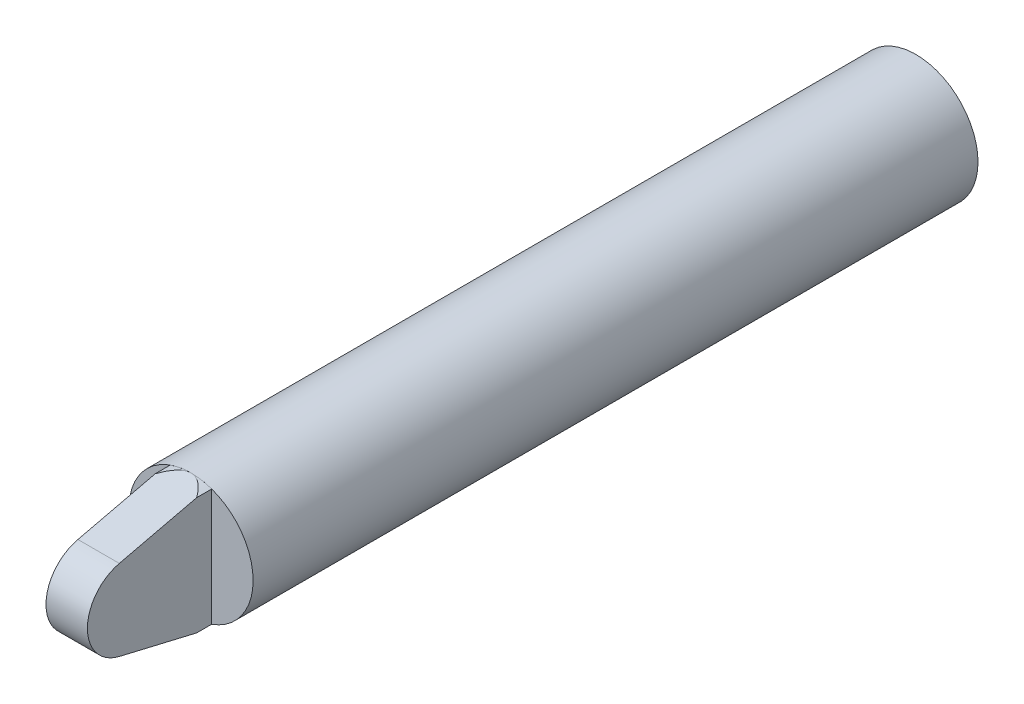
ISO-10303-21;
HEADER;
FILE_DESCRIPTION(('STEP AP214'),'2;1');
FILE_NAME('part.step','',(''),(''),'','','');
FILE_SCHEMA(('AUTOMOTIVE_DESIGN { 1 0 10303 214 1 1 1 1 }'));
ENDSEC;
DATA;
#1=APPLICATION_CONTEXT('core data for automotive mechanical design processes');
#2=APPLICATION_PROTOCOL_DEFINITION('international standard','automotive_design',2000,#1);
#3=PRODUCT_CONTEXT('',#1,'mechanical');
#4=PRODUCT('Part','Part','',(#3));
#5=PRODUCT_RELATED_PRODUCT_CATEGORY('part','',(#4));
#6=PRODUCT_DEFINITION_FORMATION('','',#4);
#7=PRODUCT_DEFINITION_CONTEXT('part definition',#1,'design');
#8=PRODUCT_DEFINITION('design','',#6,#7);
#9=PRODUCT_DEFINITION_SHAPE('','',#8);
#10=(LENGTH_UNIT() NAMED_UNIT(*) SI_UNIT(.MILLI.,.METRE.));
#11=(NAMED_UNIT(*) PLANE_ANGLE_UNIT() SI_UNIT($,.RADIAN.));
#12=(NAMED_UNIT(*) SI_UNIT($,.STERADIAN.) SOLID_ANGLE_UNIT());
#13=UNCERTAINTY_MEASURE_WITH_UNIT(LENGTH_MEASURE(1.E-05),#10,'distance_accuracy_value','');
#14=(GEOMETRIC_REPRESENTATION_CONTEXT(3) GLOBAL_UNCERTAINTY_ASSIGNED_CONTEXT((#13)) GLOBAL_UNIT_ASSIGNED_CONTEXT((#10,
#11,#12)) REPRESENTATION_CONTEXT('',''));
#15=CARTESIAN_POINT('',(0.,0.,0.));
#16=DIRECTION('',(0.,0.,1.));
#17=DIRECTION('',(1.,0.,0.));
#18=AXIS2_PLACEMENT_3D('',#15,#16,#17);
#19=CARTESIAN_POINT('',(10.,30.,350.));
#20=DIRECTION('',(0.,0.,1.));
#21=DIRECTION('',(1.,0.,0.));
#22=AXIS2_PLACEMENT_3D('',#19,#20,#21);
#23=PLANE('',#22);
#24=CARTESIAN_POINT('',(0.,0.,350.));
#25=DIRECTION('',(0.,0.,1.));
#26=DIRECTION('',(1.,0.,0.));
#27=AXIS2_PLACEMENT_3D('',#24,#25,#26);
#28=CIRCLE('',#27,30.);
#29=CARTESIAN_POINT('',(10.,28.2842712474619,350.));
#30=VERTEX_POINT('',#29);
#31=CARTESIAN_POINT('',(0.,30.,350.));
#32=VERTEX_POINT('',#31);
#33=EDGE_CURVE('E160',#30,#32,#28,.T.);
#34=ORIENTED_EDGE('',*,*,#33,.F.);
#35=DIRECTION('',(0.,1.,0.));
#36=VECTOR('',#35,1.);
#37=CARTESIAN_POINT('',(10.,30.,350.));
#38=LINE('',#37,#36);
#39=CARTESIAN_POINT('',(10.,-28.2842712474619,350.));
#40=VERTEX_POINT('',#39);
#41=EDGE_CURVE('E126',#40,#30,#38,.T.);
#42=ORIENTED_EDGE('',*,*,#41,.F.);
#43=CARTESIAN_POINT('',(0.,-30.,350.));
#44=VERTEX_POINT('',#43);
#45=EDGE_CURVE('E157',#44,#40,#28,.T.);
#46=ORIENTED_EDGE('',*,*,#45,.F.);
#47=CARTESIAN_POINT('',(-10.,-28.2842712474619,350.));
#48=VERTEX_POINT('',#47);
#49=EDGE_CURVE('E155',#48,#44,#28,.T.);
#50=ORIENTED_EDGE('',*,*,#49,.F.);
#51=DIRECTION('',(0.,1.,0.));
#52=VECTOR('',#51,1.);
#53=CARTESIAN_POINT('',(-10.,30.,350.));
#54=LINE('',#53,#52);
#55=CARTESIAN_POINT('',(-10.,28.2842712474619,350.));
#56=VERTEX_POINT('',#55);
#57=EDGE_CURVE('E116',#48,#56,#54,.T.);
#58=ORIENTED_EDGE('',*,*,#57,.T.);
#59=EDGE_CURVE('E60',#32,#56,#28,.T.);
#60=ORIENTED_EDGE('',*,*,#59,.F.);
#61=EDGE_LOOP('',(#34,#42,#46,#50,#58,#60));
#62=FACE_BOUND('',#61,.T.);
#63=ADVANCED_FACE('F39',(#62),#23,.F.);
#64=CARTESIAN_POINT('',(10.,30.,350.));
#65=DIRECTION('',(0.,-0.973212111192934,-0.229909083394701));
#66=DIRECTION('',(0.,0.229909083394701,-0.973212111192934));
#67=AXIS2_PLACEMENT_3D('',#64,#65,#66);
#68=PLANE('',#67);
#69=CARTESIAN_POINT('',(0.,0.,476.99090833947));
#70=DIRECTION('',(0.,-0.973212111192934,-0.229909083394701));
#71=DIRECTION('',(0.,0.229909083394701,-0.973212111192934));
#72=AXIS2_PLACEMENT_3D('',#69,#70,#71);
#73=ELLIPSE('',#72,130.486362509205,30.);
#74=CARTESIAN_POINT('',(10.,28.2842712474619,357.262731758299));
#75=VERTEX_POINT('',#74);
#76=EDGE_CURVE('E110',#32,#75,#73,.T.);
#77=ORIENTED_EDGE('',*,*,#76,.F.);
#78=CARTESIAN_POINT('',(-10.,28.2842712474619,357.262731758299));
#79=VERTEX_POINT('',#78);
#80=EDGE_CURVE('E97',#79,#32,#73,.T.);
#81=ORIENTED_EDGE('',*,*,#80,.F.);
#82=DIRECTION('',(0.,-0.229909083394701,0.973212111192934));
#83=VECTOR('',#82,1.);
#84=CARTESIAN_POINT('',(-10.,30.,350.));
#85=LINE('',#84,#83);
#86=CARTESIAN_POINT('',(-10.,19.4642422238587,394.598181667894));
#87=VERTEX_POINT('',#86);
#88=EDGE_CURVE('E107',#79,#87,#85,.T.);
#89=ORIENTED_EDGE('',*,*,#88,.T.);
#90=DIRECTION('',(-1.,0.,0.));
#91=VECTOR('',#90,1.);
#92=CARTESIAN_POINT('',(10.,19.4642422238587,394.598181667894));
#93=LINE('',#92,#91);
#94=CARTESIAN_POINT('',(10.,19.4642422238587,394.598181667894));
#95=VERTEX_POINT('',#94);
#96=EDGE_CURVE('E103',#95,#87,#93,.T.);
#97=ORIENTED_EDGE('',*,*,#96,.F.);
#98=DIRECTION('',(0.,-0.229909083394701,0.973212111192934));
#99=VECTOR('',#98,1.);
#100=CARTESIAN_POINT('',(10.,30.,350.));
#101=LINE('',#100,#99);
#102=EDGE_CURVE('E136',#75,#95,#101,.T.);
#103=ORIENTED_EDGE('',*,*,#102,.F.);
#104=EDGE_LOOP('',(#77,#81,#89,#97,#103));
#105=FACE_BOUND('',#104,.T.);
#106=ADVANCED_FACE('F105',(#105),#68,.F.);
#107=CARTESIAN_POINT('',(10.,-30.,350.));
#108=DIRECTION('',(0.,0.973212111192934,-0.229909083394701));
#109=DIRECTION('',(0.,0.229909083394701,0.973212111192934));
#110=AXIS2_PLACEMENT_3D('',#107,#108,#109);
#111=PLANE('',#110);
#112=CARTESIAN_POINT('',(0.,0.,476.99090833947));
#113=DIRECTION('',(0.,0.973212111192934,-0.229909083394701));
#114=DIRECTION('',(0.,-0.229909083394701,-0.973212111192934));
#115=AXIS2_PLACEMENT_3D('',#112,#113,#114);
#116=ELLIPSE('',#115,130.486362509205,30.);
#117=CARTESIAN_POINT('',(-10.,-28.2842712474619,357.262731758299));
#118=VERTEX_POINT('',#117);
#119=EDGE_CURVE('E52',#44,#118,#116,.T.);
#120=ORIENTED_EDGE('',*,*,#119,.F.);
#121=CARTESIAN_POINT('',(10.,-28.2842712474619,357.262731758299));
#122=VERTEX_POINT('',#121);
#123=EDGE_CURVE('E120',#122,#44,#116,.T.);
#124=ORIENTED_EDGE('',*,*,#123,.F.);
#125=DIRECTION('',(0.,-0.229909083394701,-0.973212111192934));
#126=VECTOR('',#125,1.);
#127=CARTESIAN_POINT('',(10.,-30.,350.));
#128=LINE('',#127,#126);
#129=CARTESIAN_POINT('',(10.,-19.4642422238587,394.598181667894));
#130=VERTEX_POINT('',#129);
#131=EDGE_CURVE('E130',#130,#122,#128,.T.);
#132=ORIENTED_EDGE('',*,*,#131,.F.);
#133=DIRECTION('',(-1.,0.,0.));
#134=VECTOR('',#133,1.);
#135=CARTESIAN_POINT('',(10.,-19.4642422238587,394.598181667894));
#136=LINE('',#135,#134);
#137=CARTESIAN_POINT('',(-10.,-19.4642422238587,394.598181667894));
#138=VERTEX_POINT('',#137);
#139=EDGE_CURVE('E127',#130,#138,#136,.T.);
#140=ORIENTED_EDGE('',*,*,#139,.T.);
#141=DIRECTION('',(0.,-0.229909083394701,-0.973212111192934));
#142=VECTOR('',#141,1.);
#143=CARTESIAN_POINT('',(-10.,-30.,350.));
#144=LINE('',#143,#142);
#145=EDGE_CURVE('E118',#138,#118,#144,.T.);
#146=ORIENTED_EDGE('',*,*,#145,.T.);
#147=EDGE_LOOP('',(#120,#124,#132,#140,#146));
#148=FACE_BOUND('',#147,.T.);
#149=ADVANCED_FACE('F152',(#148),#111,.F.);
#150=CARTESIAN_POINT('',(10.,0.,390.));
#151=DIRECTION('',(1.,0.,0.));
#152=DIRECTION('',(0.,0.,-1.));
#153=AXIS2_PLACEMENT_3D('',#150,#151,#152);
#154=PLANE('',#153);
#155=ORIENTED_EDGE('',*,*,#131,.T.);
#156=DIRECTION('',(0.,0.,-1.));
#157=VECTOR('',#156,1.);
#158=CARTESIAN_POINT('',(10.,-28.2842712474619,410.));
#159=LINE('',#158,#157);
#160=EDGE_CURVE('E148',#122,#40,#159,.T.);
#161=ORIENTED_EDGE('',*,*,#160,.T.);
#162=ORIENTED_EDGE('',*,*,#41,.T.);
#163=DIRECTION('',(0.,0.,-1.));
#164=VECTOR('',#163,1.);
#165=CARTESIAN_POINT('',(10.,28.2842712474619,410.));
#166=LINE('',#165,#164);
#167=EDGE_CURVE('E158',#30,#75,#166,.F.);
#168=ORIENTED_EDGE('',*,*,#167,.T.);
#169=ORIENTED_EDGE('',*,*,#102,.T.);
#170=CARTESIAN_POINT('',(10.,0.,390.));
#171=DIRECTION('',(1.,0.,0.));
#172=DIRECTION('',(0.,0.,-1.));
#173=AXIS2_PLACEMENT_3D('',#170,#171,#172);
#174=CIRCLE('',#173,20.);
#175=EDGE_CURVE('E135',#95,#130,#174,.T.);
#176=ORIENTED_EDGE('',*,*,#175,.T.);
#177=EDGE_LOOP('',(#155,#161,#162,#168,#169,#176));
#178=FACE_BOUND('',#177,.T.);
#179=ADVANCED_FACE('F147',(#178),#154,.T.);
#180=CARTESIAN_POINT('',(-10.,0.,390.));
#181=DIRECTION('',(1.,0.,0.));
#182=DIRECTION('',(0.,0.,-1.));
#183=AXIS2_PLACEMENT_3D('',#180,#181,#182);
#184=PLANE('',#183);
#185=DIRECTION('',(0.,0.,-1.));
#186=VECTOR('',#185,1.);
#187=CARTESIAN_POINT('',(-10.,-28.2842712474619,410.));
#188=LINE('',#187,#186);
#189=EDGE_CURVE('E13',#118,#48,#188,.T.);
#190=ORIENTED_EDGE('',*,*,#189,.F.);
#191=ORIENTED_EDGE('',*,*,#145,.F.);
#192=CARTESIAN_POINT('',(-10.,0.,390.));
#193=DIRECTION('',(1.,0.,0.));
#194=DIRECTION('',(0.,0.,-1.));
#195=AXIS2_PLACEMENT_3D('',#192,#193,#194);
#196=CIRCLE('',#195,20.);
#197=EDGE_CURVE('E115',#87,#138,#196,.T.);
#198=ORIENTED_EDGE('',*,*,#197,.F.);
#199=ORIENTED_EDGE('',*,*,#88,.F.);
#200=DIRECTION('',(0.,0.,-1.));
#201=VECTOR('',#200,1.);
#202=CARTESIAN_POINT('',(-10.,28.2842712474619,410.));
#203=LINE('',#202,#201);
#204=EDGE_CURVE('E46',#56,#79,#203,.F.);
#205=ORIENTED_EDGE('',*,*,#204,.F.);
#206=ORIENTED_EDGE('',*,*,#57,.F.);
#207=EDGE_LOOP('',(#190,#191,#198,#199,#205,#206));
#208=FACE_BOUND('',#207,.T.);
#209=ADVANCED_FACE('F113',(#208),#184,.F.);
#210=CARTESIAN_POINT('',(10.,0.,390.));
#211=DIRECTION('',(-1.,0.,0.));
#212=DIRECTION('',(0.,0.,1.));
#213=AXIS2_PLACEMENT_3D('',#210,#211,#212);
#214=CYLINDRICAL_SURFACE('',#213,20.);
#215=ORIENTED_EDGE('',*,*,#197,.T.);
#216=ORIENTED_EDGE('',*,*,#139,.F.);
#217=ORIENTED_EDGE('',*,*,#175,.F.);
#218=ORIENTED_EDGE('',*,*,#96,.T.);
#219=EDGE_LOOP('',(#215,#216,#217,#218));
#220=FACE_BOUND('',#219,.T.);
#221=ADVANCED_FACE('F133',(#220),#214,.T.);
#222=CARTESIAN_POINT('',(0.,0.,410.));
#223=DIRECTION('',(0.,0.,-1.));
#224=DIRECTION('',(-1.,0.,0.));
#225=AXIS2_PLACEMENT_3D('',#222,#223,#224);
#226=CYLINDRICAL_SURFACE('',#225,30.);
#227=ORIENTED_EDGE('',*,*,#59,.T.);
#228=ORIENTED_EDGE('',*,*,#204,.T.);
#229=ORIENTED_EDGE('',*,*,#80,.T.);
#230=EDGE_LOOP('',(#227,#228,#229));
#231=FACE_BOUND('',#230,.T.);
#232=ADVANCED_FACE('F96',(#231),#226,.T.);
#233=ORIENTED_EDGE('',*,*,#49,.T.);
#234=ORIENTED_EDGE('',*,*,#119,.T.);
#235=ORIENTED_EDGE('',*,*,#189,.T.);
#236=EDGE_LOOP('',(#233,#234,#235));
#237=FACE_BOUND('',#236,.T.);
#238=ADVANCED_FACE('F163',(#237),#226,.T.);
#239=ORIENTED_EDGE('',*,*,#33,.T.);
#240=ORIENTED_EDGE('',*,*,#76,.T.);
#241=ORIENTED_EDGE('',*,*,#167,.F.);
#242=EDGE_LOOP('',(#239,#240,#241));
#243=FACE_BOUND('',#242,.T.);
#244=ADVANCED_FACE('F168',(#243),#226,.T.);
#245=ORIENTED_EDGE('',*,*,#123,.T.);
#246=ORIENTED_EDGE('',*,*,#45,.T.);
#247=ORIENTED_EDGE('',*,*,#160,.F.);
#248=EDGE_LOOP('',(#245,#246,#247));
#249=FACE_BOUND('',#248,.T.);
#250=ADVANCED_FACE('F166',(#249),#226,.T.);
#251=CLOSED_SHELL('',(#63,#106,#149,#179,#209,#221,#232,#238,#244,#250));
#252=MANIFOLD_SOLID_BREP('B2',#251);
#253=CARTESIAN_POINT('',(0.,0.,350.));
#254=DIRECTION('',(0.,0.,-1.));
#255=DIRECTION('',(-1.,0.,0.));
#256=AXIS2_PLACEMENT_3D('',#253,#254,#255);
#257=CYLINDRICAL_SURFACE('',#256,30.);
#258=CARTESIAN_POINT('',(0.,0.,350.));
#259=DIRECTION('',(0.,0.,1.));
#260=DIRECTION('',(1.,0.,0.));
#261=AXIS2_PLACEMENT_3D('',#258,#259,#260);
#262=CIRCLE('',#261,30.);
#263=CARTESIAN_POINT('',(30.,0.,350.));
#264=VERTEX_POINT('',#263);
#265=EDGE_CURVE('E38',#264,#264,#262,.T.);
#266=ORIENTED_EDGE('',*,*,#265,.F.);
#267=EDGE_LOOP('',(#266));
#268=FACE_BOUND('',#267,.T.);
#269=CARTESIAN_POINT('',(0.,0.,0.));
#270=DIRECTION('',(0.,0.,1.));
#271=DIRECTION('',(1.,0.,0.));
#272=AXIS2_PLACEMENT_3D('',#269,#270,#271);
#273=CIRCLE('',#272,30.);
#274=CARTESIAN_POINT('',(30.,0.,0.));
#275=VERTEX_POINT('',#274);
#276=EDGE_CURVE('E249',#275,#275,#273,.T.);
#277=ORIENTED_EDGE('',*,*,#276,.T.);
#278=EDGE_LOOP('',(#277));
#279=FACE_BOUND('',#278,.T.);
#280=ADVANCED_FACE('F246',(#268,#279),#257,.T.);
#281=CARTESIAN_POINT('',(0.,0.,350.));
#282=DIRECTION('',(0.,0.,1.));
#283=DIRECTION('',(1.,0.,0.));
#284=AXIS2_PLACEMENT_3D('',#281,#282,#283);
#285=PLANE('',#284);
#286=ORIENTED_EDGE('',*,*,#265,.T.);
#287=EDGE_LOOP('',(#286));
#288=FACE_BOUND('',#287,.T.);
#289=ADVANCED_FACE('F261',(#288),#285,.T.);
#290=CARTESIAN_POINT('',(0.,0.,0.));
#291=DIRECTION('',(0.,0.,1.));
#292=DIRECTION('',(1.,0.,0.));
#293=AXIS2_PLACEMENT_3D('',#290,#291,#292);
#294=PLANE('',#293);
#295=ORIENTED_EDGE('',*,*,#276,.F.);
#296=EDGE_LOOP('',(#295));
#297=FACE_BOUND('',#296,.T.);
#298=ADVANCED_FACE('F259',(#297),#294,.F.);
#299=CLOSED_SHELL('',(#280,#289,#298));
#300=MANIFOLD_SOLID_BREP('B7',#299);
#301=ADVANCED_BREP_SHAPE_REPRESENTATION('',(#18,#252,#300),#14);
#302=SHAPE_DEFINITION_REPRESENTATION(#9,#301);
ENDSEC;
END-ISO-10303-21;
